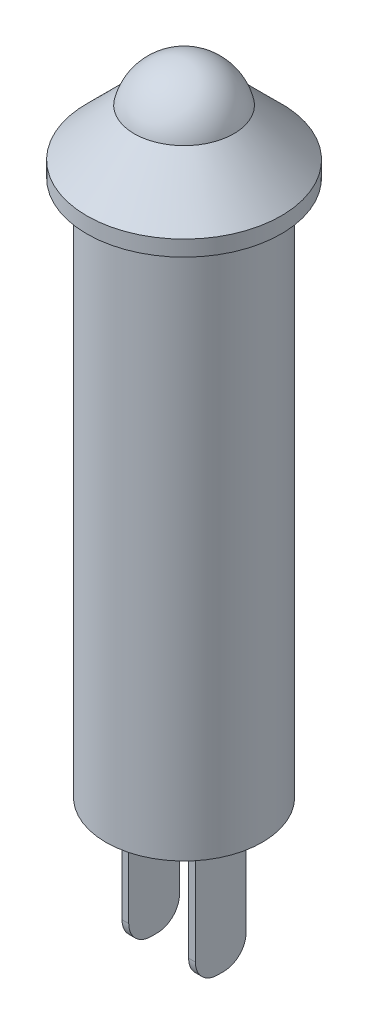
ISO-10303-21;
HEADER;
FILE_DESCRIPTION(('STEP AP214'),'2;1');
FILE_NAME('part.step','',(''),(''),'','','');
FILE_SCHEMA(('AUTOMOTIVE_DESIGN { 1 0 10303 214 1 1 1 1 }'));
ENDSEC;
DATA;
#1=APPLICATION_CONTEXT('core data for automotive mechanical design processes');
#2=APPLICATION_PROTOCOL_DEFINITION('international standard','automotive_design',2000,#1);
#3=PRODUCT_CONTEXT('',#1,'mechanical');
#4=PRODUCT('Part','Part','',(#3));
#5=PRODUCT_RELATED_PRODUCT_CATEGORY('part','',(#4));
#6=PRODUCT_DEFINITION_FORMATION('','',#4);
#7=PRODUCT_DEFINITION_CONTEXT('part definition',#1,'design');
#8=PRODUCT_DEFINITION('design','',#6,#7);
#9=PRODUCT_DEFINITION_SHAPE('','',#8);
#10=(LENGTH_UNIT() NAMED_UNIT(*) SI_UNIT(.MILLI.,.METRE.));
#11=(NAMED_UNIT(*) PLANE_ANGLE_UNIT() SI_UNIT($,.RADIAN.));
#12=(NAMED_UNIT(*) SI_UNIT($,.STERADIAN.) SOLID_ANGLE_UNIT());
#13=UNCERTAINTY_MEASURE_WITH_UNIT(LENGTH_MEASURE(1.E-05),#10,'distance_accuracy_value','');
#14=(GEOMETRIC_REPRESENTATION_CONTEXT(3) GLOBAL_UNCERTAINTY_ASSIGNED_CONTEXT((#13)) GLOBAL_UNIT_ASSIGNED_CONTEXT((#10,
#11,#12)) REPRESENTATION_CONTEXT('',''));
#15=CARTESIAN_POINT('',(0.,0.,0.));
#16=DIRECTION('',(0.,0.,1.));
#17=DIRECTION('',(1.,0.,0.));
#18=AXIS2_PLACEMENT_3D('',#15,#16,#17);
#19=CARTESIAN_POINT('',(0.,0.,0.));
#20=DIRECTION('',(0.,1.,0.));
#21=DIRECTION('',(0.,0.,1.));
#22=AXIS2_PLACEMENT_3D('',#19,#20,#21);
#23=PLANE('',#22);
#24=DIRECTION('',(0.,0.,1.));
#25=VECTOR('',#24,1.);
#26=CARTESIAN_POINT('',(2.08279999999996,0.,1.44145000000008));
#27=LINE('',#26,#25);
#28=CARTESIAN_POINT('',(2.08279999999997,0.,-1.44144999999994));
#29=VERTEX_POINT('',#28);
#30=CARTESIAN_POINT('',(2.08279999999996,0.,1.44145000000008));
#31=VERTEX_POINT('',#30);
#32=EDGE_CURVE('E165',#29,#31,#27,.T.);
#33=ORIENTED_EDGE('',*,*,#32,.F.);
#34=DIRECTION('',(1.,0.,0.));
#35=VECTOR('',#34,1.);
#36=CARTESIAN_POINT('',(2.08279999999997,0.,-1.44144999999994));
#37=LINE('',#36,#35);
#38=CARTESIAN_POINT('',(1.7018,0.,-1.44144999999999));
#39=VERTEX_POINT('',#38);
#40=EDGE_CURVE('E174',#39,#29,#37,.T.);
#41=ORIENTED_EDGE('',*,*,#40,.F.);
#42=DIRECTION('',(0.,0.,-1.));
#43=VECTOR('',#42,1.);
#44=CARTESIAN_POINT('',(1.70179999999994,0.,1.44145000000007));
#45=LINE('',#44,#43);
#46=CARTESIAN_POINT('',(1.70179999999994,0.,1.44145000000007));
#47=VERTEX_POINT('',#46);
#48=EDGE_CURVE('E171',#47,#39,#45,.T.);
#49=ORIENTED_EDGE('',*,*,#48,.F.);
#50=DIRECTION('',(-1.,0.,0.));
#51=VECTOR('',#50,1.);
#52=CARTESIAN_POINT('',(2.08279999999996,0.,1.44145000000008));
#53=LINE('',#52,#51);
#54=EDGE_CURVE('E168',#31,#47,#53,.T.);
#55=ORIENTED_EDGE('',*,*,#54,.F.);
#56=EDGE_LOOP('',(#33,#41,#49,#55));
#57=FACE_BOUND('',#56,.T.);
#58=CARTESIAN_POINT('',(0.,0.,0.));
#59=DIRECTION('',(0.,1.,0.));
#60=DIRECTION('',(0.,0.,1.));
#61=AXIS2_PLACEMENT_3D('',#58,#59,#60);
#62=CIRCLE('',#61,4.445);
#63=CARTESIAN_POINT('',(0.,0.,4.44500000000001));
#64=VERTEX_POINT('',#63);
#65=EDGE_CURVE('E203',#64,#64,#62,.T.);
#66=ORIENTED_EDGE('',*,*,#65,.F.);
#67=EDGE_LOOP('',(#66));
#68=FACE_BOUND('',#67,.T.);
#69=DIRECTION('',(0.,0.,1.));
#70=VECTOR('',#69,1.);
#71=CARTESIAN_POINT('',(-1.70180000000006,0.,1.44145000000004));
#72=LINE('',#71,#70);
#73=CARTESIAN_POINT('',(-1.70180000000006,0.,-1.44144999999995));
#74=VERTEX_POINT('',#73);
#75=CARTESIAN_POINT('',(-1.70180000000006,0.,1.44145000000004));
#76=VERTEX_POINT('',#75);
#77=EDGE_CURVE('E131',#74,#76,#72,.T.);
#78=ORIENTED_EDGE('',*,*,#77,.F.);
#79=DIRECTION('',(1.,0.,0.));
#80=VECTOR('',#79,1.);
#81=CARTESIAN_POINT('',(-1.70180000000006,0.,-1.44144999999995));
#82=LINE('',#81,#80);
#83=CARTESIAN_POINT('',(-2.08280000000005,0.,-1.44144999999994));
#84=VERTEX_POINT('',#83);
#85=EDGE_CURVE('E143',#84,#74,#82,.T.);
#86=ORIENTED_EDGE('',*,*,#85,.F.);
#87=DIRECTION('',(0.,0.,-1.));
#88=VECTOR('',#87,1.);
#89=CARTESIAN_POINT('',(-2.08280000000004,0.,1.44145000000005));
#90=LINE('',#89,#88);
#91=CARTESIAN_POINT('',(-2.08280000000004,0.,1.44145000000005));
#92=VERTEX_POINT('',#91);
#93=EDGE_CURVE('E151',#92,#84,#90,.T.);
#94=ORIENTED_EDGE('',*,*,#93,.F.);
#95=DIRECTION('',(-1.,0.,0.));
#96=VECTOR('',#95,1.);
#97=CARTESIAN_POINT('',(-1.70180000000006,0.,1.44145000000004));
#98=LINE('',#97,#96);
#99=EDGE_CURVE('E146',#76,#92,#98,.T.);
#100=ORIENTED_EDGE('',*,*,#99,.F.);
#101=EDGE_LOOP('',(#78,#86,#94,#100));
#102=FACE_BOUND('',#101,.T.);
#103=ADVANCED_FACE('F35',(#57,#68,#102),#23,.F.);
#104=CARTESIAN_POINT('',(0.,0.,0.));
#105=DIRECTION('',(0.,1.,0.));
#106=DIRECTION('',(0.,0.,1.));
#107=AXIS2_PLACEMENT_3D('',#104,#105,#106);
#108=CYLINDRICAL_SURFACE('',#107,4.445);
#109=CARTESIAN_POINT('',(0.,30.48,0.));
#110=DIRECTION('',(0.,1.,0.));
#111=DIRECTION('',(0.,0.,1.));
#112=AXIS2_PLACEMENT_3D('',#109,#110,#111);
#113=CIRCLE('',#112,4.445);
#114=CARTESIAN_POINT('',(0.,30.48,4.445));
#115=VERTEX_POINT('',#114);
#116=EDGE_CURVE('E200',#115,#115,#113,.T.);
#117=ORIENTED_EDGE('',*,*,#116,.F.);
#118=EDGE_LOOP('',(#117));
#119=FACE_BOUND('',#118,.T.);
#120=ORIENTED_EDGE('',*,*,#65,.T.);
#121=EDGE_LOOP('',(#120));
#122=FACE_BOUND('',#121,.T.);
#123=ADVANCED_FACE('F267',(#119,#122),#108,.T.);
#124=CARTESIAN_POINT('',(4.445,30.48,0.));
#125=DIRECTION('',(0.,1.,0.));
#126=DIRECTION('',(0.,0.,1.));
#127=AXIS2_PLACEMENT_3D('',#124,#125,#126);
#128=PLANE('',#127);
#129=CARTESIAN_POINT('',(0.,30.48,0.));
#130=DIRECTION('',(0.,1.,0.));
#131=DIRECTION('',(0.,0.,1.));
#132=AXIS2_PLACEMENT_3D('',#129,#130,#131);
#133=CIRCLE('',#132,5.5245);
#134=CARTESIAN_POINT('',(0.,30.48,5.5245));
#135=VERTEX_POINT('',#134);
#136=EDGE_CURVE('E197',#135,#135,#133,.T.);
#137=ORIENTED_EDGE('',*,*,#136,.F.);
#138=EDGE_LOOP('',(#137));
#139=FACE_BOUND('',#138,.T.);
#140=ORIENTED_EDGE('',*,*,#116,.T.);
#141=EDGE_LOOP('',(#140));
#142=FACE_BOUND('',#141,.T.);
#143=ADVANCED_FACE('F271',(#139,#142),#128,.F.);
#144=CARTESIAN_POINT('',(0.,0.,0.));
#145=DIRECTION('',(0.,1.,0.));
#146=DIRECTION('',(0.,0.,1.));
#147=AXIS2_PLACEMENT_3D('',#144,#145,#146);
#148=CYLINDRICAL_SURFACE('',#147,5.5245);
#149=CARTESIAN_POINT('',(0.,31.369,0.));
#150=DIRECTION('',(0.,1.,0.));
#151=DIRECTION('',(0.,0.,1.));
#152=AXIS2_PLACEMENT_3D('',#149,#150,#151);
#153=CIRCLE('',#152,5.5245);
#154=CARTESIAN_POINT('',(0.,31.369,5.52450000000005));
#155=VERTEX_POINT('',#154);
#156=EDGE_CURVE('E194',#155,#155,#153,.T.);
#157=ORIENTED_EDGE('',*,*,#156,.F.);
#158=EDGE_LOOP('',(#157));
#159=FACE_BOUND('',#158,.T.);
#160=ORIENTED_EDGE('',*,*,#136,.T.);
#161=EDGE_LOOP('',(#160));
#162=FACE_BOUND('',#161,.T.);
#163=ADVANCED_FACE('F276',(#159,#162),#148,.T.);
#164=CARTESIAN_POINT('',(0.,31.369,0.));
#165=DIRECTION('',(0.,-1.,0.));
#166=DIRECTION('',(0.,0.,-1.));
#167=AXIS2_PLACEMENT_3D('',#164,#165,#166);
#168=CONICAL_SURFACE('',#167,5.5245,0.785398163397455);
#169=CARTESIAN_POINT('',(0.,34.0630768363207,0.));
#170=DIRECTION('',(0.,1.,0.));
#171=DIRECTION('',(0.,0.,1.));
#172=AXIS2_PLACEMENT_3D('',#169,#170,#171);
#173=CIRCLE('',#172,2.83042316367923);
#174=CARTESIAN_POINT('',(0.,34.0630768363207,2.83042316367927));
#175=VERTEX_POINT('',#174);
#176=EDGE_CURVE('E191',#175,#175,#173,.T.);
#177=ORIENTED_EDGE('',*,*,#176,.F.);
#178=EDGE_LOOP('',(#177));
#179=FACE_BOUND('',#178,.T.);
#180=ORIENTED_EDGE('',*,*,#156,.T.);
#181=EDGE_LOOP('',(#180));
#182=FACE_BOUND('',#181,.T.);
#183=ADVANCED_FACE('F284',(#179,#182),#168,.T.);
#184=CARTESIAN_POINT('',(0.,33.4010363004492,-0.0145624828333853));
#185=DIRECTION('',(-1.,0.,0.));
#186=DIRECTION('',(0.,0.,1.));
#187=AXIS2_PLACEMENT_3D('',#184,#185,#186);
#188=CIRCLE('',#187,2.921);
#189=TRIMMED_CURVE('',#188,(PARAMETER_VALUE(-1.56581086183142)),
(PARAMETER_VALUE(1.56581086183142)),.T.,.PARAMETER.);
#190=CARTESIAN_POINT('',(0.,33.4010363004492,0.));
#191=DIRECTION('',(0.,1.,0.));
#192=AXIS1_PLACEMENT('',#190,#191);
#193=SURFACE_OF_REVOLUTION('',#189,#192);
#194=CARTESIAN_POINT('',(0.,36.322,0.));
#195=VERTEX_POINT('',#194);
#196=VERTEX_LOOP('',#195);
#197=FACE_BOUND('',#196,.T.);
#198=ORIENTED_EDGE('',*,*,#176,.T.);
#199=EDGE_LOOP('',(#198));
#200=FACE_BOUND('',#199,.T.);
#201=ADVANCED_FACE('F288',(#197,#200),#193,.T.);
#202=CARTESIAN_POINT('',(2.0828,-7.61999999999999,1.44145000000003));
#203=DIRECTION('',(-1.,0.,0.));
#204=DIRECTION('',(0.,0.,1.));
#205=AXIS2_PLACEMENT_3D('',#202,#203,#204);
#206=PLANE('',#205);
#207=DIRECTION('',(0.,0.,1.));
#208=VECTOR('',#207,1.);
#209=CARTESIAN_POINT('',(2.0828,-7.61999999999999,1.44145000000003));
#210=LINE('',#209,#208);
#211=CARTESIAN_POINT('',(2.0828,-7.62,-0.171449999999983));
#212=VERTEX_POINT('',#211);
#213=CARTESIAN_POINT('',(2.08279999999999,-7.62,0.171450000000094));
#214=VERTEX_POINT('',#213);
#215=EDGE_CURVE('E177',#212,#214,#210,.T.);
#216=ORIENTED_EDGE('',*,*,#215,.F.);
#217=CARTESIAN_POINT('',(2.08279999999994,-6.35,-0.171449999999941));
#218=DIRECTION('',(-1.,0.,0.));
#219=DIRECTION('',(0.,0.,1.));
#220=AXIS2_PLACEMENT_3D('',#217,#218,#219);
#221=CIRCLE('',#220,1.27);
#222=CARTESIAN_POINT('',(2.0828,-6.35,-1.44144999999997));
#223=VERTEX_POINT('',#222);
#224=EDGE_CURVE('E231',#212,#223,#221,.F.);
#225=ORIENTED_EDGE('',*,*,#224,.T.);
#226=DIRECTION('',(0.,1.,0.));
#227=VECTOR('',#226,1.);
#228=CARTESIAN_POINT('',(2.08280000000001,-7.61999999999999,-1.44144999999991));
#229=LINE('',#228,#227);
#230=EDGE_CURVE('E183',#223,#29,#229,.T.);
#231=ORIENTED_EDGE('',*,*,#230,.T.);
#232=ORIENTED_EDGE('',*,*,#32,.T.);
#233=DIRECTION('',(0.,1.,0.));
#234=VECTOR('',#233,1.);
#235=CARTESIAN_POINT('',(2.0828,-7.61999999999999,1.44145000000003));
#236=LINE('',#235,#234);
#237=CARTESIAN_POINT('',(2.0828,-6.34999999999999,1.44145000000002));
#238=VERTEX_POINT('',#237);
#239=EDGE_CURVE('E189',#238,#31,#236,.T.);
#240=ORIENTED_EDGE('',*,*,#239,.F.);
#241=CARTESIAN_POINT('',(2.08279999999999,-6.35,0.171450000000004));
#242=DIRECTION('',(-1.,0.,0.));
#243=DIRECTION('',(0.,0.,1.));
#244=AXIS2_PLACEMENT_3D('',#241,#242,#243);
#245=CIRCLE('',#244,1.27);
#246=EDGE_CURVE('E229',#238,#214,#245,.F.);
#247=ORIENTED_EDGE('',*,*,#246,.T.);
#248=EDGE_LOOP('',(#216,#225,#231,#232,#240,#247));
#249=FACE_BOUND('',#248,.T.);
#250=ADVANCED_FACE('F244',(#249),#206,.F.);
#251=CARTESIAN_POINT('',(2.0828,-7.61999999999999,1.44145000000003));
#252=DIRECTION('',(0.,0.,-1.));
#253=DIRECTION('',(-1.,0.,0.));
#254=AXIS2_PLACEMENT_3D('',#251,#252,#253);
#255=PLANE('',#254);
#256=DIRECTION('',(0.,1.,0.));
#257=VECTOR('',#256,1.);
#258=CARTESIAN_POINT('',(1.7018,-7.61999999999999,1.4414500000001));
#259=LINE('',#258,#257);
#260=CARTESIAN_POINT('',(1.7018,-6.34999999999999,1.44145000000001));
#261=VERTEX_POINT('',#260);
#262=EDGE_CURVE('E187',#261,#47,#259,.T.);
#263=ORIENTED_EDGE('',*,*,#262,.F.);
#264=DIRECTION('',(-1.,0.,0.));
#265=VECTOR('',#264,1.);
#266=CARTESIAN_POINT('',(2.0828,-6.34999999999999,1.44145000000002));
#267=LINE('',#266,#265);
#268=EDGE_CURVE('E11',#261,#238,#267,.F.);
#269=ORIENTED_EDGE('',*,*,#268,.T.);
#270=ORIENTED_EDGE('',*,*,#239,.T.);
#271=ORIENTED_EDGE('',*,*,#54,.T.);
#272=EDGE_LOOP('',(#263,#269,#270,#271));
#273=FACE_BOUND('',#272,.T.);
#274=ADVANCED_FACE('F254',(#273),#255,.F.);
#275=CARTESIAN_POINT('',(1.7018,-7.61999999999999,1.4414500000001));
#276=DIRECTION('',(1.,0.,0.));
#277=DIRECTION('',(0.,0.,-1.));
#278=AXIS2_PLACEMENT_3D('',#275,#276,#277);
#279=PLANE('',#278);
#280=DIRECTION('',(0.,1.,0.));
#281=VECTOR('',#280,1.);
#282=CARTESIAN_POINT('',(1.7018,-7.62,-1.44145));
#283=LINE('',#282,#281);
#284=CARTESIAN_POINT('',(1.7018,-6.35,-1.44145));
#285=VERTEX_POINT('',#284);
#286=EDGE_CURVE('E185',#285,#39,#283,.T.);
#287=ORIENTED_EDGE('',*,*,#286,.F.);
#288=CARTESIAN_POINT('',(1.7018,-6.35,-0.171450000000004));
#289=DIRECTION('',(1.,0.,0.));
#290=DIRECTION('',(0.,0.,-1.));
#291=AXIS2_PLACEMENT_3D('',#288,#289,#290);
#292=CIRCLE('',#291,1.27);
#293=CARTESIAN_POINT('',(1.70180000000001,-7.62,-0.17144999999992));
#294=VERTEX_POINT('',#293);
#295=EDGE_CURVE('E42',#285,#294,#292,.F.);
#296=ORIENTED_EDGE('',*,*,#295,.T.);
#297=DIRECTION('',(0.,0.,-1.));
#298=VECTOR('',#297,1.);
#299=CARTESIAN_POINT('',(1.7018,-7.61999999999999,1.4414500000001));
#300=LINE('',#299,#298);
#301=CARTESIAN_POINT('',(1.70180000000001,-7.62,0.171450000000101));
#302=VERTEX_POINT('',#301);
#303=EDGE_CURVE('E180',#302,#294,#300,.T.);
#304=ORIENTED_EDGE('',*,*,#303,.F.);
#305=CARTESIAN_POINT('',(1.7018,-6.35,0.171450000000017));
#306=DIRECTION('',(1.,0.,0.));
#307=DIRECTION('',(0.,0.,-1.));
#308=AXIS2_PLACEMENT_3D('',#305,#306,#307);
#309=CIRCLE('',#308,1.27);
#310=EDGE_CURVE('E49',#302,#261,#309,.F.);
#311=ORIENTED_EDGE('',*,*,#310,.T.);
#312=ORIENTED_EDGE('',*,*,#262,.T.);
#313=ORIENTED_EDGE('',*,*,#48,.T.);
#314=EDGE_LOOP('',(#287,#296,#304,#311,#312,#313));
#315=FACE_BOUND('',#314,.T.);
#316=ADVANCED_FACE('F235',(#315),#279,.F.);
#317=CARTESIAN_POINT('',(2.08280000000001,-7.61999999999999,-1.44144999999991));
#318=DIRECTION('',(0.,0.,1.));
#319=DIRECTION('',(1.,0.,0.));
#320=AXIS2_PLACEMENT_3D('',#317,#318,#319);
#321=PLANE('',#320);
#322=ORIENTED_EDGE('',*,*,#230,.F.);
#323=DIRECTION('',(1.,0.,0.));
#324=VECTOR('',#323,1.);
#325=CARTESIAN_POINT('',(2.0828,-6.35,-1.44144999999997));
#326=LINE('',#325,#324);
#327=EDGE_CURVE('E57',#223,#285,#326,.F.);
#328=ORIENTED_EDGE('',*,*,#327,.T.);
#329=ORIENTED_EDGE('',*,*,#286,.T.);
#330=ORIENTED_EDGE('',*,*,#40,.T.);
#331=EDGE_LOOP('',(#322,#328,#329,#330));
#332=FACE_BOUND('',#331,.T.);
#333=ADVANCED_FACE('F246',(#332),#321,.F.);
#334=CARTESIAN_POINT('',(2.08280000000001,-7.61999999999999,-1.44144999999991));
#335=DIRECTION('',(0.,1.,0.));
#336=DIRECTION('',(0.,0.,1.));
#337=AXIS2_PLACEMENT_3D('',#334,#335,#336);
#338=PLANE('',#337);
#339=ORIENTED_EDGE('',*,*,#303,.T.);
#340=DIRECTION('',(1.,0.,0.));
#341=VECTOR('',#340,1.);
#342=CARTESIAN_POINT('',(2.0828,-7.62,-0.171449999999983));
#343=LINE('',#342,#341);
#344=EDGE_CURVE('E226',#294,#212,#343,.T.);
#345=ORIENTED_EDGE('',*,*,#344,.T.);
#346=ORIENTED_EDGE('',*,*,#215,.T.);
#347=DIRECTION('',(-1.,0.,0.));
#348=VECTOR('',#347,1.);
#349=CARTESIAN_POINT('',(2.08279999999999,-7.62,0.171450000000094));
#350=LINE('',#349,#348);
#351=EDGE_CURVE('E223',#214,#302,#350,.T.);
#352=ORIENTED_EDGE('',*,*,#351,.T.);
#353=EDGE_LOOP('',(#339,#345,#346,#352));
#354=FACE_BOUND('',#353,.T.);
#355=ADVANCED_FACE('F239',(#354),#338,.F.);
#356=CARTESIAN_POINT('',(-1.7018,-7.62,1.44145000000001));
#357=DIRECTION('',(-1.,0.,0.));
#358=DIRECTION('',(0.,0.,1.));
#359=AXIS2_PLACEMENT_3D('',#356,#357,#358);
#360=PLANE('',#359);
#361=DIRECTION('',(0.,0.,1.));
#362=VECTOR('',#361,1.);
#363=CARTESIAN_POINT('',(-1.7018,-7.62,1.44145000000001));
#364=LINE('',#363,#362);
#365=CARTESIAN_POINT('',(-1.7018,-7.62000000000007,-0.171449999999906));
#366=VERTEX_POINT('',#365);
#367=CARTESIAN_POINT('',(-1.7018,-7.61999999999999,0.17145000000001));
#368=VERTEX_POINT('',#367);
#369=EDGE_CURVE('E150',#366,#368,#364,.T.);
#370=ORIENTED_EDGE('',*,*,#369,.F.);
#371=CARTESIAN_POINT('',(-1.70180000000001,-6.35000000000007,-0.171449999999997));
#372=DIRECTION('',(-1.,0.,0.));
#373=DIRECTION('',(0.,0.,1.));
#374=AXIS2_PLACEMENT_3D('',#371,#372,#373);
#375=CIRCLE('',#374,1.27);
#376=CARTESIAN_POINT('',(-1.70180000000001,-6.35,-1.44145));
#377=VERTEX_POINT('',#376);
#378=EDGE_CURVE('E132',#366,#377,#375,.F.);
#379=ORIENTED_EDGE('',*,*,#378,.T.);
#380=DIRECTION('',(0.,1.,0.));
#381=VECTOR('',#380,1.);
#382=CARTESIAN_POINT('',(-1.7018,-7.62,-1.44144999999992));
#383=LINE('',#382,#381);
#384=EDGE_CURVE('E126',#377,#74,#383,.T.);
#385=ORIENTED_EDGE('',*,*,#384,.T.);
#386=ORIENTED_EDGE('',*,*,#77,.T.);
#387=DIRECTION('',(0.,1.,0.));
#388=VECTOR('',#387,1.);
#389=CARTESIAN_POINT('',(-1.7018,-7.62,1.44145000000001));
#390=LINE('',#389,#388);
#391=CARTESIAN_POINT('',(-1.70180000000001,-6.35,1.44145));
#392=VERTEX_POINT('',#391);
#393=EDGE_CURVE('E163',#392,#76,#390,.T.);
#394=ORIENTED_EDGE('',*,*,#393,.F.);
#395=CARTESIAN_POINT('',(-1.70180000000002,-6.34999999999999,0.171450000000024));
#396=DIRECTION('',(-1.,0.,0.));
#397=DIRECTION('',(0.,0.,1.));
#398=AXIS2_PLACEMENT_3D('',#395,#396,#397);
#399=CIRCLE('',#398,1.27);
#400=EDGE_CURVE('E212',#392,#368,#399,.F.);
#401=ORIENTED_EDGE('',*,*,#400,.T.);
#402=EDGE_LOOP('',(#370,#379,#385,#386,#394,#401));
#403=FACE_BOUND('',#402,.T.);
#404=ADVANCED_FACE('F129',(#403),#360,.F.);
#405=CARTESIAN_POINT('',(-1.7018,-7.62,1.44145000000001));
#406=DIRECTION('',(0.,0.,-1.));
#407=DIRECTION('',(-1.,0.,0.));
#408=AXIS2_PLACEMENT_3D('',#405,#406,#407);
#409=PLANE('',#408);
#410=DIRECTION('',(0.,1.,0.));
#411=VECTOR('',#410,1.);
#412=CARTESIAN_POINT('',(-2.0828,-7.62,1.44145000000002));
#413=LINE('',#412,#411);
#414=CARTESIAN_POINT('',(-2.0828,-6.35,1.44145));
#415=VERTEX_POINT('',#414);
#416=EDGE_CURVE('E161',#415,#92,#413,.T.);
#417=ORIENTED_EDGE('',*,*,#416,.F.);
#418=DIRECTION('',(-1.,0.,0.));
#419=VECTOR('',#418,1.);
#420=CARTESIAN_POINT('',(-1.70180000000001,-6.35,1.44145));
#421=LINE('',#420,#419);
#422=EDGE_CURVE('E221',#415,#392,#421,.F.);
#423=ORIENTED_EDGE('',*,*,#422,.T.);
#424=ORIENTED_EDGE('',*,*,#393,.T.);
#425=ORIENTED_EDGE('',*,*,#99,.T.);
#426=EDGE_LOOP('',(#417,#423,#424,#425));
#427=FACE_BOUND('',#426,.T.);
#428=ADVANCED_FACE('F305',(#427),#409,.F.);
#429=CARTESIAN_POINT('',(-2.0828,-7.62,1.44145000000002));
#430=DIRECTION('',(1.,0.,0.));
#431=DIRECTION('',(0.,0.,-1.));
#432=AXIS2_PLACEMENT_3D('',#429,#430,#431);
#433=PLANE('',#432);
#434=DIRECTION('',(0.,1.,0.));
#435=VECTOR('',#434,1.);
#436=CARTESIAN_POINT('',(-2.0828,-7.62,-1.44144999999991));
#437=LINE('',#436,#435);
#438=CARTESIAN_POINT('',(-2.0828,-6.35,-1.44144999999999));
#439=VERTEX_POINT('',#438);
#440=EDGE_CURVE('E136',#439,#84,#437,.T.);
#441=ORIENTED_EDGE('',*,*,#440,.F.);
#442=CARTESIAN_POINT('',(-2.08280000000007,-6.34999999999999,-0.171449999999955));
#443=DIRECTION('',(1.,0.,0.));
#444=DIRECTION('',(0.,0.,-1.));
#445=AXIS2_PLACEMENT_3D('',#442,#443,#444);
#446=CIRCLE('',#445,1.27);
#447=CARTESIAN_POINT('',(-2.0828,-7.61999999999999,-0.171449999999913));
#448=VERTEX_POINT('',#447);
#449=EDGE_CURVE('E219',#439,#448,#446,.F.);
#450=ORIENTED_EDGE('',*,*,#449,.T.);
#451=DIRECTION('',(0.,0.,-1.));
#452=VECTOR('',#451,1.);
#453=CARTESIAN_POINT('',(-2.0828,-7.62,1.44145000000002));
#454=LINE('',#453,#452);
#455=CARTESIAN_POINT('',(-2.0828,-7.61999999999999,0.171450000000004));
#456=VERTEX_POINT('',#455);
#457=EDGE_CURVE('E137',#456,#448,#454,.T.);
#458=ORIENTED_EDGE('',*,*,#457,.F.);
#459=CARTESIAN_POINT('',(-2.0828,-6.34999999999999,0.171449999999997));
#460=DIRECTION('',(1.,0.,0.));
#461=DIRECTION('',(0.,0.,-1.));
#462=AXIS2_PLACEMENT_3D('',#459,#460,#461);
#463=CIRCLE('',#462,1.27);
#464=EDGE_CURVE('E217',#456,#415,#463,.F.);
#465=ORIENTED_EDGE('',*,*,#464,.T.);
#466=ORIENTED_EDGE('',*,*,#416,.T.);
#467=ORIENTED_EDGE('',*,*,#93,.T.);
#468=EDGE_LOOP('',(#441,#450,#458,#465,#466,#467));
#469=FACE_BOUND('',#468,.T.);
#470=ADVANCED_FACE('F308',(#469),#433,.F.);
#471=CARTESIAN_POINT('',(-1.7018,-7.62,-1.44144999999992));
#472=DIRECTION('',(0.,0.,1.));
#473=DIRECTION('',(1.,0.,0.));
#474=AXIS2_PLACEMENT_3D('',#471,#472,#473);
#475=PLANE('',#474);
#476=ORIENTED_EDGE('',*,*,#384,.F.);
#477=DIRECTION('',(1.,0.,0.));
#478=VECTOR('',#477,1.);
#479=CARTESIAN_POINT('',(-1.70180000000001,-6.35,-1.44145));
#480=LINE('',#479,#478);
#481=EDGE_CURVE('E215',#377,#439,#480,.F.);
#482=ORIENTED_EDGE('',*,*,#481,.T.);
#483=ORIENTED_EDGE('',*,*,#440,.T.);
#484=ORIENTED_EDGE('',*,*,#85,.T.);
#485=EDGE_LOOP('',(#476,#482,#483,#484));
#486=FACE_BOUND('',#485,.T.);
#487=ADVANCED_FACE('F148',(#486),#475,.F.);
#488=CARTESIAN_POINT('',(-1.7018,-7.62,1.44145000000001));
#489=DIRECTION('',(0.,1.,0.));
#490=DIRECTION('',(0.,0.,1.));
#491=AXIS2_PLACEMENT_3D('',#488,#489,#490);
#492=PLANE('',#491);
#493=ORIENTED_EDGE('',*,*,#457,.T.);
#494=DIRECTION('',(1.,0.,0.));
#495=VECTOR('',#494,1.);
#496=CARTESIAN_POINT('',(-1.7018,-7.62000000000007,-0.171449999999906));
#497=LINE('',#496,#495);
#498=EDGE_CURVE('E209',#448,#366,#497,.T.);
#499=ORIENTED_EDGE('',*,*,#498,.T.);
#500=ORIENTED_EDGE('',*,*,#369,.T.);
#501=DIRECTION('',(-1.,0.,0.));
#502=VECTOR('',#501,1.);
#503=CARTESIAN_POINT('',(-1.7018,-7.61999999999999,0.17145000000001));
#504=LINE('',#503,#502);
#505=EDGE_CURVE('E206',#368,#456,#504,.T.);
#506=ORIENTED_EDGE('',*,*,#505,.T.);
#507=EDGE_LOOP('',(#493,#499,#500,#506));
#508=FACE_BOUND('',#507,.T.);
#509=ADVANCED_FACE('F315',(#508),#492,.F.);
#510=CARTESIAN_POINT('',(-1.70180000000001,-6.35000000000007,-0.171449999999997));
#511=DIRECTION('',(1.,0.,0.));
#512=DIRECTION('',(0.,0.,-1.));
#513=AXIS2_PLACEMENT_3D('',#510,#511,#512);
#514=CYLINDRICAL_SURFACE('',#513,1.27);
#515=ORIENTED_EDGE('',*,*,#449,.F.);
#516=ORIENTED_EDGE('',*,*,#481,.F.);
#517=ORIENTED_EDGE('',*,*,#378,.F.);
#518=ORIENTED_EDGE('',*,*,#498,.F.);
#519=EDGE_LOOP('',(#515,#516,#517,#518));
#520=FACE_BOUND('',#519,.T.);
#521=ADVANCED_FACE('F318',(#520),#514,.T.);
#522=CARTESIAN_POINT('',(-1.70180000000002,-6.34999999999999,0.171450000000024));
#523=DIRECTION('',(-1.,0.,0.));
#524=DIRECTION('',(0.,0.,1.));
#525=AXIS2_PLACEMENT_3D('',#522,#523,#524);
#526=CYLINDRICAL_SURFACE('',#525,1.27);
#527=ORIENTED_EDGE('',*,*,#400,.F.);
#528=ORIENTED_EDGE('',*,*,#422,.F.);
#529=ORIENTED_EDGE('',*,*,#464,.F.);
#530=ORIENTED_EDGE('',*,*,#505,.F.);
#531=EDGE_LOOP('',(#527,#528,#529,#530));
#532=FACE_BOUND('',#531,.T.);
#533=ADVANCED_FACE('F264',(#532),#526,.T.);
#534=CARTESIAN_POINT('',(2.08279999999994,-6.35,-0.171449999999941));
#535=DIRECTION('',(1.,0.,0.));
#536=DIRECTION('',(0.,0.,-1.));
#537=AXIS2_PLACEMENT_3D('',#534,#535,#536);
#538=CYLINDRICAL_SURFACE('',#537,1.27);
#539=ORIENTED_EDGE('',*,*,#295,.F.);
#540=ORIENTED_EDGE('',*,*,#327,.F.);
#541=ORIENTED_EDGE('',*,*,#224,.F.);
#542=ORIENTED_EDGE('',*,*,#344,.F.);
#543=EDGE_LOOP('',(#539,#540,#541,#542));
#544=FACE_BOUND('',#543,.T.);
#545=ADVANCED_FACE('F242',(#544),#538,.T.);
#546=CARTESIAN_POINT('',(2.08279999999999,-6.35,0.171450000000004));
#547=DIRECTION('',(-1.,0.,0.));
#548=DIRECTION('',(0.,0.,1.));
#549=AXIS2_PLACEMENT_3D('',#546,#547,#548);
#550=CYLINDRICAL_SURFACE('',#549,1.27);
#551=ORIENTED_EDGE('',*,*,#246,.F.);
#552=ORIENTED_EDGE('',*,*,#268,.F.);
#553=ORIENTED_EDGE('',*,*,#310,.F.);
#554=ORIENTED_EDGE('',*,*,#351,.F.);
#555=EDGE_LOOP('',(#551,#552,#553,#554));
#556=FACE_BOUND('',#555,.T.);
#557=ADVANCED_FACE('F258',(#556),#550,.T.);
#558=CLOSED_SHELL('',(#103,#123,#143,#163,#183,#201,#250,#274,#316,#333,#355,#404,#428,#470,
#487,#509,#521,#533,#545,#557));
#559=MANIFOLD_SOLID_BREP('B2',#558);
#560=ADVANCED_BREP_SHAPE_REPRESENTATION('',(#18,#559),#14);
#561=SHAPE_DEFINITION_REPRESENTATION(#9,#560);
ENDSEC;
END-ISO-10303-21;
